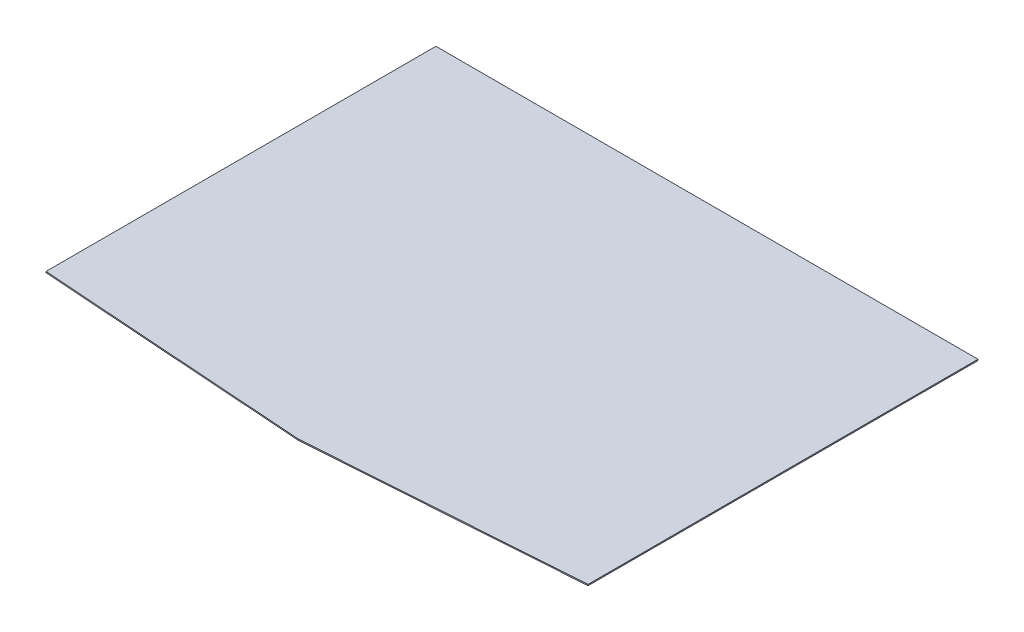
ISO-10303-21;
HEADER;
FILE_DESCRIPTION(('STEP AP214'),'2;1');
FILE_NAME('part.step','',(''),(''),'','','');
FILE_SCHEMA(('AUTOMOTIVE_DESIGN { 1 0 10303 214 1 1 1 1 }'));
ENDSEC;
DATA;
#1=APPLICATION_CONTEXT('core data for automotive mechanical design processes');
#2=APPLICATION_PROTOCOL_DEFINITION('international standard','automotive_design',2000,#1);
#3=PRODUCT_CONTEXT('',#1,'mechanical');
#4=PRODUCT('Part','Part','',(#3));
#5=PRODUCT_RELATED_PRODUCT_CATEGORY('part','',(#4));
#6=PRODUCT_DEFINITION_FORMATION('','',#4);
#7=PRODUCT_DEFINITION_CONTEXT('part definition',#1,'design');
#8=PRODUCT_DEFINITION('design','',#6,#7);
#9=PRODUCT_DEFINITION_SHAPE('','',#8);
#10=(LENGTH_UNIT() NAMED_UNIT(*) SI_UNIT(.MILLI.,.METRE.));
#11=(NAMED_UNIT(*) PLANE_ANGLE_UNIT() SI_UNIT($,.RADIAN.));
#12=(NAMED_UNIT(*) SI_UNIT($,.STERADIAN.) SOLID_ANGLE_UNIT());
#13=UNCERTAINTY_MEASURE_WITH_UNIT(LENGTH_MEASURE(1.E-05),#10,'distance_accuracy_value','');
#14=(GEOMETRIC_REPRESENTATION_CONTEXT(3) GLOBAL_UNCERTAINTY_ASSIGNED_CONTEXT((#13)) GLOBAL_UNIT_ASSIGNED_CONTEXT((#10,
#11,#12)) REPRESENTATION_CONTEXT('',''));
#15=CARTESIAN_POINT('',(0.,0.,0.));
#16=DIRECTION('',(0.,0.,1.));
#17=DIRECTION('',(1.,0.,0.));
#18=AXIS2_PLACEMENT_3D('',#15,#16,#17);
#19=CARTESIAN_POINT('',(1111.25,-4.7625,838.2));
#20=DIRECTION('',(0.,1.,0.));
#21=DIRECTION('',(0.,0.,1.));
#22=AXIS2_PLACEMENT_3D('',#19,#20,#21);
#23=PLANE('',#22);
#24=DIRECTION('',(-0.997564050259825,0.,0.0697564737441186));
#25=VECTOR('',#24,1.);
#26=CARTESIAN_POINT('',(1111.25,-4.7625,760.493830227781));
#27=LINE('',#26,#25);
#28=CARTESIAN_POINT('',(1111.25,-4.7625,760.493830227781));
#29=VERTEX_POINT('',#28);
#30=CARTESIAN_POINT('',(-5.99520433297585E-12,-4.7625,838.2));
#31=VERTEX_POINT('',#30);
#32=EDGE_CURVE('E109',#29,#31,#27,.T.);
#33=ORIENTED_EDGE('',*,*,#32,.T.);
#34=DIRECTION('',(-0.997564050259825,0.,-0.0697564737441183));
#35=VECTOR('',#34,1.);
#36=CARTESIAN_POINT('',(0.,-4.7625,838.2));
#37=LINE('',#36,#35);
#38=CARTESIAN_POINT('',(-1111.25,-4.7625,760.493830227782));
#39=VERTEX_POINT('',#38);
#40=EDGE_CURVE('E102',#31,#39,#37,.T.);
#41=ORIENTED_EDGE('',*,*,#40,.T.);
#42=DIRECTION('',(0.,0.,1.));
#43=VECTOR('',#42,1.);
#44=CARTESIAN_POINT('',(-1111.25,-4.7625,-838.2));
#45=LINE('',#44,#43);
#46=CARTESIAN_POINT('',(-1111.25,-4.7625,-838.2));
#47=VERTEX_POINT('',#46);
#48=EDGE_CURVE('E96',#47,#39,#45,.T.);
#49=ORIENTED_EDGE('',*,*,#48,.F.);
#50=DIRECTION('',(-1.,0.,0.));
#51=VECTOR('',#50,1.);
#52=CARTESIAN_POINT('',(-1111.25,-4.7625,-838.2));
#53=LINE('',#52,#51);
#54=CARTESIAN_POINT('',(1111.25,-4.7625,-838.2));
#55=VERTEX_POINT('',#54);
#56=EDGE_CURVE('E77',#55,#47,#53,.T.);
#57=ORIENTED_EDGE('',*,*,#56,.F.);
#58=DIRECTION('',(0.,0.,-1.));
#59=VECTOR('',#58,1.);
#60=CARTESIAN_POINT('',(1111.25,-4.7625,-838.2));
#61=LINE('',#60,#59);
#62=EDGE_CURVE('E87',#29,#55,#61,.T.);
#63=ORIENTED_EDGE('',*,*,#62,.F.);
#64=EDGE_LOOP('',(#33,#41,#49,#57,#63));
#65=FACE_BOUND('',#64,.T.);
#66=ADVANCED_FACE('F37',(#65),#23,.F.);
#67=CARTESIAN_POINT('',(1111.25,0.,838.2));
#68=DIRECTION('',(0.,1.,0.));
#69=DIRECTION('',(0.,0.,1.));
#70=AXIS2_PLACEMENT_3D('',#67,#68,#69);
#71=PLANE('',#70);
#72=DIRECTION('',(-0.997564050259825,0.,-0.0697564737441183));
#73=VECTOR('',#72,1.);
#74=CARTESIAN_POINT('',(0.,0.,838.2));
#75=LINE('',#74,#73);
#76=CARTESIAN_POINT('',(-5.99520433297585E-12,0.,838.2));
#77=VERTEX_POINT('',#76);
#78=CARTESIAN_POINT('',(-1111.25,0.,760.493830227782));
#79=VERTEX_POINT('',#78);
#80=EDGE_CURVE('E104',#77,#79,#75,.T.);
#81=ORIENTED_EDGE('',*,*,#80,.F.);
#82=DIRECTION('',(-0.997564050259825,0.,0.0697564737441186));
#83=VECTOR('',#82,1.);
#84=CARTESIAN_POINT('',(1111.25,0.,760.493830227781));
#85=LINE('',#84,#83);
#86=CARTESIAN_POINT('',(1111.25,0.,760.493830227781));
#87=VERTEX_POINT('',#86);
#88=EDGE_CURVE('E52',#87,#77,#85,.T.);
#89=ORIENTED_EDGE('',*,*,#88,.F.);
#90=DIRECTION('',(0.,0.,-1.));
#91=VECTOR('',#90,1.);
#92=CARTESIAN_POINT('',(1111.25,0.,-838.2));
#93=LINE('',#92,#91);
#94=CARTESIAN_POINT('',(1111.25,0.,-838.2));
#95=VERTEX_POINT('',#94);
#96=EDGE_CURVE('E91',#87,#95,#93,.T.);
#97=ORIENTED_EDGE('',*,*,#96,.T.);
#98=DIRECTION('',(-1.,0.,0.));
#99=VECTOR('',#98,1.);
#100=CARTESIAN_POINT('',(-1111.25,0.,-838.2));
#101=LINE('',#100,#99);
#102=CARTESIAN_POINT('',(-1111.25,0.,-838.2));
#103=VERTEX_POINT('',#102);
#104=EDGE_CURVE('E75',#95,#103,#101,.T.);
#105=ORIENTED_EDGE('',*,*,#104,.T.);
#106=DIRECTION('',(0.,0.,1.));
#107=VECTOR('',#106,1.);
#108=CARTESIAN_POINT('',(-1111.25,0.,-838.2));
#109=LINE('',#108,#107);
#110=EDGE_CURVE('E80',#103,#79,#109,.T.);
#111=ORIENTED_EDGE('',*,*,#110,.T.);
#112=EDGE_LOOP('',(#81,#89,#97,#105,#111));
#113=FACE_BOUND('',#112,.T.);
#114=ADVANCED_FACE('F89',(#113),#71,.T.);
#115=CARTESIAN_POINT('',(1111.25,-4.7625,-838.2));
#116=DIRECTION('',(1.,0.,0.));
#117=DIRECTION('',(0.,0.,-1.));
#118=AXIS2_PLACEMENT_3D('',#115,#116,#117);
#119=PLANE('',#118);
#120=ORIENTED_EDGE('',*,*,#96,.F.);
#121=DIRECTION('',(0.,1.,0.));
#122=VECTOR('',#121,1.);
#123=CARTESIAN_POINT('',(1111.25,0.,760.493830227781));
#124=LINE('',#123,#122);
#125=EDGE_CURVE('E112',#87,#29,#124,.F.);
#126=ORIENTED_EDGE('',*,*,#125,.T.);
#127=ORIENTED_EDGE('',*,*,#62,.T.);
#128=DIRECTION('',(0.,1.,0.));
#129=VECTOR('',#128,1.);
#130=CARTESIAN_POINT('',(1111.25,-4.7625,-838.2));
#131=LINE('',#130,#129);
#132=EDGE_CURVE('E41',#55,#95,#131,.T.);
#133=ORIENTED_EDGE('',*,*,#132,.T.);
#134=EDGE_LOOP('',(#120,#126,#127,#133));
#135=FACE_BOUND('',#134,.T.);
#136=ADVANCED_FACE('F39',(#135),#119,.T.);
#137=CARTESIAN_POINT('',(-1111.25,-4.7625,-838.2));
#138=DIRECTION('',(-1.,0.,0.));
#139=DIRECTION('',(0.,0.,1.));
#140=AXIS2_PLACEMENT_3D('',#137,#138,#139);
#141=PLANE('',#140);
#142=ORIENTED_EDGE('',*,*,#48,.T.);
#143=DIRECTION('',(0.,1.,0.));
#144=VECTOR('',#143,1.);
#145=CARTESIAN_POINT('',(-1111.25,0.,760.493830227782));
#146=LINE('',#145,#144);
#147=EDGE_CURVE('E84',#79,#39,#146,.F.);
#148=ORIENTED_EDGE('',*,*,#147,.F.);
#149=ORIENTED_EDGE('',*,*,#110,.F.);
#150=DIRECTION('',(0.,1.,0.));
#151=VECTOR('',#150,1.);
#152=CARTESIAN_POINT('',(-1111.25,-4.7625,-838.2));
#153=LINE('',#152,#151);
#154=EDGE_CURVE('E11',#47,#103,#153,.T.);
#155=ORIENTED_EDGE('',*,*,#154,.F.);
#156=EDGE_LOOP('',(#142,#148,#149,#155));
#157=FACE_BOUND('',#156,.T.);
#158=ADVANCED_FACE('F81',(#157),#141,.T.);
#159=CARTESIAN_POINT('',(-1111.25,-4.7625,-838.2));
#160=DIRECTION('',(0.,0.,-1.));
#161=DIRECTION('',(-1.,0.,0.));
#162=AXIS2_PLACEMENT_3D('',#159,#160,#161);
#163=PLANE('',#162);
#164=ORIENTED_EDGE('',*,*,#104,.F.);
#165=ORIENTED_EDGE('',*,*,#132,.F.);
#166=ORIENTED_EDGE('',*,*,#56,.T.);
#167=ORIENTED_EDGE('',*,*,#154,.T.);
#168=EDGE_LOOP('',(#164,#165,#166,#167));
#169=FACE_BOUND('',#168,.T.);
#170=ADVANCED_FACE('F72',(#169),#163,.T.);
#171=CARTESIAN_POINT('',(0.,0.,838.2));
#172=DIRECTION('',(0.0697564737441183,0.,-0.997564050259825));
#173=DIRECTION('',(-0.997564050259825,0.,-0.0697564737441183));
#174=AXIS2_PLACEMENT_3D('',#171,#172,#173);
#175=PLANE('',#174);
#176=ORIENTED_EDGE('',*,*,#80,.T.);
#177=ORIENTED_EDGE('',*,*,#147,.T.);
#178=ORIENTED_EDGE('',*,*,#40,.F.);
#179=DIRECTION('',(0.,1.,0.));
#180=VECTOR('',#179,1.);
#181=CARTESIAN_POINT('',(-5.99520433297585E-12,0.,838.2));
#182=LINE('',#181,#180);
#183=EDGE_CURVE('E100',#77,#31,#182,.F.);
#184=ORIENTED_EDGE('',*,*,#183,.F.);
#185=EDGE_LOOP('',(#176,#177,#178,#184));
#186=FACE_BOUND('',#185,.T.);
#187=ADVANCED_FACE('F129',(#186),#175,.F.);
#188=CARTESIAN_POINT('',(1111.25,0.,760.493830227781));
#189=DIRECTION('',(-0.0697564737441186,0.,-0.997564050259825));
#190=DIRECTION('',(-0.997564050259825,0.,0.0697564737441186));
#191=AXIS2_PLACEMENT_3D('',#188,#189,#190);
#192=PLANE('',#191);
#193=ORIENTED_EDGE('',*,*,#88,.T.);
#194=ORIENTED_EDGE('',*,*,#183,.T.);
#195=ORIENTED_EDGE('',*,*,#32,.F.);
#196=ORIENTED_EDGE('',*,*,#125,.F.);
#197=EDGE_LOOP('',(#193,#194,#195,#196));
#198=FACE_BOUND('',#197,.T.);
#199=ADVANCED_FACE('F128',(#198),#192,.F.);
#200=CLOSED_SHELL('',(#66,#114,#136,#158,#170,#187,#199));
#201=MANIFOLD_SOLID_BREP('B2',#200);
#202=ADVANCED_BREP_SHAPE_REPRESENTATION('',(#18,#201),#14);
#203=SHAPE_DEFINITION_REPRESENTATION(#9,#202);
ENDSEC;
END-ISO-10303-21;
